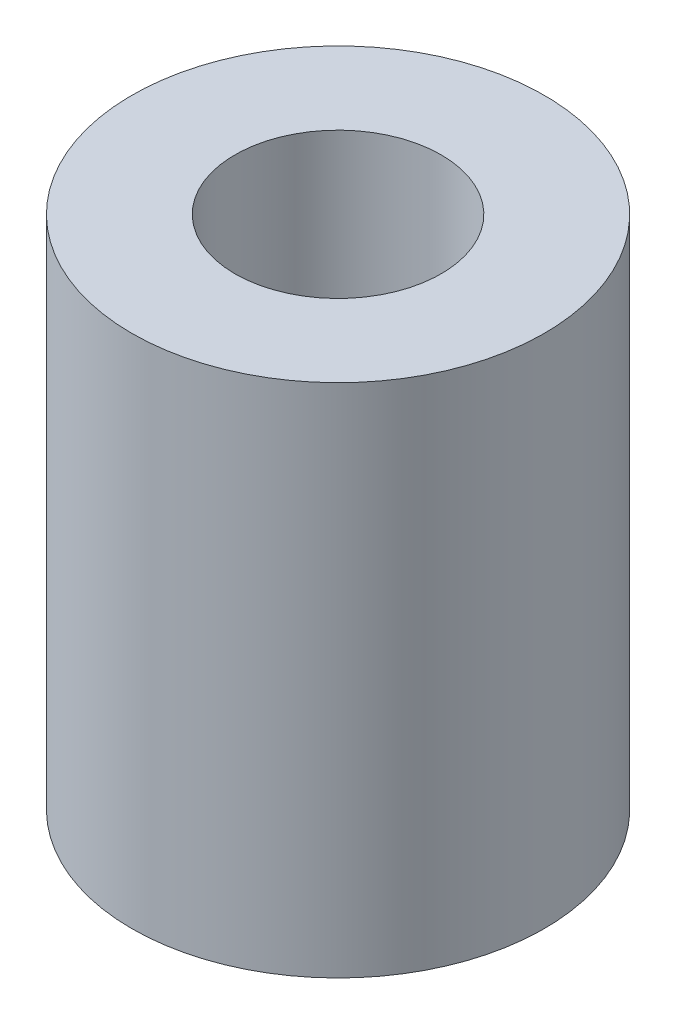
ISO-10303-21;
HEADER;
FILE_DESCRIPTION(('STEP AP214'),'2;1');
FILE_NAME('part.step','',(''),(''),'','','');
FILE_SCHEMA(('AUTOMOTIVE_DESIGN { 1 0 10303 214 1 1 1 1 }'));
ENDSEC;
DATA;
#1=APPLICATION_CONTEXT('core data for automotive mechanical design processes');
#2=APPLICATION_PROTOCOL_DEFINITION('international standard','automotive_design',2000,#1);
#3=PRODUCT_CONTEXT('',#1,'mechanical');
#4=PRODUCT('Part','Part','',(#3));
#5=PRODUCT_RELATED_PRODUCT_CATEGORY('part','',(#4));
#6=PRODUCT_DEFINITION_FORMATION('','',#4);
#7=PRODUCT_DEFINITION_CONTEXT('part definition',#1,'design');
#8=PRODUCT_DEFINITION('design','',#6,#7);
#9=PRODUCT_DEFINITION_SHAPE('','',#8);
#10=(LENGTH_UNIT() NAMED_UNIT(*) SI_UNIT(.MILLI.,.METRE.));
#11=(NAMED_UNIT(*) PLANE_ANGLE_UNIT() SI_UNIT($,.RADIAN.));
#12=(NAMED_UNIT(*) SI_UNIT($,.STERADIAN.) SOLID_ANGLE_UNIT());
#13=UNCERTAINTY_MEASURE_WITH_UNIT(LENGTH_MEASURE(1.E-05),#10,'distance_accuracy_value','');
#14=(GEOMETRIC_REPRESENTATION_CONTEXT(3) GLOBAL_UNCERTAINTY_ASSIGNED_CONTEXT((#13)) GLOBAL_UNIT_ASSIGNED_CONTEXT((#10,
#11,#12)) REPRESENTATION_CONTEXT('',''));
#15=CARTESIAN_POINT('',(0.,0.,0.));
#16=DIRECTION('',(0.,0.,1.));
#17=DIRECTION('',(1.,0.,0.));
#18=AXIS2_PLACEMENT_3D('',#15,#16,#17);
#19=CARTESIAN_POINT('',(0.,40.,0.));
#20=DIRECTION('',(0.,-1.,0.));
#21=DIRECTION('',(0.,0.,-1.));
#22=AXIS2_PLACEMENT_3D('',#19,#20,#21);
#23=CYLINDRICAL_SURFACE('',#22,16.);
#24=CARTESIAN_POINT('',(0.,40.,0.));
#25=DIRECTION('',(0.,1.,0.));
#26=DIRECTION('',(0.,0.,1.));
#27=AXIS2_PLACEMENT_3D('',#24,#25,#26);
#28=CIRCLE('',#27,16.);
#29=CARTESIAN_POINT('',(0.,40.,16.));
#30=VERTEX_POINT('',#29);
#31=EDGE_CURVE('E10',#30,#30,#28,.T.);
#32=ORIENTED_EDGE('',*,*,#31,.F.);
#33=EDGE_LOOP('',(#32));
#34=FACE_BOUND('',#33,.T.);
#35=CARTESIAN_POINT('',(0.,0.,0.));
#36=DIRECTION('',(0.,1.,0.));
#37=DIRECTION('',(0.,0.,1.));
#38=AXIS2_PLACEMENT_3D('',#35,#36,#37);
#39=CIRCLE('',#38,16.);
#40=CARTESIAN_POINT('',(0.,0.,16.));
#41=VERTEX_POINT('',#40);
#42=EDGE_CURVE('E45',#41,#41,#39,.T.);
#43=ORIENTED_EDGE('',*,*,#42,.T.);
#44=EDGE_LOOP('',(#43));
#45=FACE_BOUND('',#44,.T.);
#46=ADVANCED_FACE('F39',(#34,#45),#23,.T.);
#47=CARTESIAN_POINT('',(0.,40.,0.));
#48=DIRECTION('',(0.,1.,0.));
#49=DIRECTION('',(0.,0.,1.));
#50=AXIS2_PLACEMENT_3D('',#47,#48,#49);
#51=PLANE('',#50);
#52=CARTESIAN_POINT('',(0.,40.,0.));
#53=DIRECTION('',(0.,1.,0.));
#54=DIRECTION('',(0.,0.,1.));
#55=AXIS2_PLACEMENT_3D('',#52,#53,#54);
#56=CIRCLE('',#55,8.);
#57=CARTESIAN_POINT('',(0.,40.,8.));
#58=VERTEX_POINT('',#57);
#59=EDGE_CURVE('E51',#58,#58,#56,.T.);
#60=ORIENTED_EDGE('',*,*,#59,.F.);
#61=EDGE_LOOP('',(#60));
#62=FACE_BOUND('',#61,.T.);
#63=ORIENTED_EDGE('',*,*,#31,.T.);
#64=EDGE_LOOP('',(#63));
#65=FACE_BOUND('',#64,.T.);
#66=ADVANCED_FACE('F77',(#62,#65),#51,.T.);
#67=CARTESIAN_POINT('',(0.,0.,0.));
#68=DIRECTION('',(0.,1.,0.));
#69=DIRECTION('',(0.,0.,1.));
#70=AXIS2_PLACEMENT_3D('',#67,#68,#69);
#71=PLANE('',#70);
#72=CARTESIAN_POINT('',(0.,0.,0.));
#73=DIRECTION('',(0.,-1.,0.));
#74=DIRECTION('',(0.,0.,-1.));
#75=AXIS2_PLACEMENT_3D('',#72,#73,#74);
#76=CIRCLE('',#75,4.);
#77=CARTESIAN_POINT('',(0.,0.,-4.));
#78=VERTEX_POINT('',#77);
#79=EDGE_CURVE('E60',#78,#78,#76,.T.);
#80=ORIENTED_EDGE('',*,*,#79,.F.);
#81=EDGE_LOOP('',(#80));
#82=FACE_BOUND('',#81,.T.);
#83=ORIENTED_EDGE('',*,*,#42,.F.);
#84=EDGE_LOOP('',(#83));
#85=FACE_BOUND('',#84,.T.);
#86=ADVANCED_FACE('F72',(#82,#85),#71,.F.);
#87=CARTESIAN_POINT('',(0.,20.,0.));
#88=DIRECTION('',(0.,1.,0.));
#89=DIRECTION('',(0.,0.,1.));
#90=AXIS2_PLACEMENT_3D('',#87,#88,#89);
#91=CYLINDRICAL_SURFACE('',#90,8.);
#92=CARTESIAN_POINT('',(0.,20.,0.));
#93=DIRECTION('',(0.,1.,0.));
#94=DIRECTION('',(0.,0.,1.));
#95=AXIS2_PLACEMENT_3D('',#92,#93,#94);
#96=CIRCLE('',#95,8.);
#97=CARTESIAN_POINT('',(0.,20.,8.));
#98=VERTEX_POINT('',#97);
#99=EDGE_CURVE('E47',#98,#98,#96,.T.);
#100=ORIENTED_EDGE('',*,*,#99,.F.);
#101=EDGE_LOOP('',(#100));
#102=FACE_BOUND('',#101,.T.);
#103=ORIENTED_EDGE('',*,*,#59,.T.);
#104=EDGE_LOOP('',(#103));
#105=FACE_BOUND('',#104,.T.);
#106=ADVANCED_FACE('F75',(#102,#105),#91,.F.);
#107=CARTESIAN_POINT('',(0.,20.,0.));
#108=DIRECTION('',(0.,1.,0.));
#109=DIRECTION('',(0.,0.,1.));
#110=AXIS2_PLACEMENT_3D('',#107,#108,#109);
#111=PLANE('',#110);
#112=CARTESIAN_POINT('',(0.,20.,0.));
#113=DIRECTION('',(0.,-1.,0.));
#114=DIRECTION('',(0.,0.,-1.));
#115=AXIS2_PLACEMENT_3D('',#112,#113,#114);
#116=CIRCLE('',#115,4.);
#117=CARTESIAN_POINT('',(0.,20.,-4.));
#118=VERTEX_POINT('',#117);
#119=EDGE_CURVE('E53',#118,#118,#116,.T.);
#120=ORIENTED_EDGE('',*,*,#119,.T.);
#121=EDGE_LOOP('',(#120));
#122=FACE_BOUND('',#121,.T.);
#123=ORIENTED_EDGE('',*,*,#99,.T.);
#124=EDGE_LOOP('',(#123));
#125=FACE_BOUND('',#124,.T.);
#126=ADVANCED_FACE('F64',(#122,#125),#111,.T.);
#127=CARTESIAN_POINT('',(0.,20.,0.));
#128=DIRECTION('',(0.,-1.,0.));
#129=DIRECTION('',(0.,0.,-1.));
#130=AXIS2_PLACEMENT_3D('',#127,#128,#129);
#131=CYLINDRICAL_SURFACE('',#130,4.);
#132=ORIENTED_EDGE('',*,*,#119,.F.);
#133=EDGE_LOOP('',(#132));
#134=FACE_BOUND('',#133,.T.);
#135=ORIENTED_EDGE('',*,*,#79,.T.);
#136=EDGE_LOOP('',(#135));
#137=FACE_BOUND('',#136,.T.);
#138=ADVANCED_FACE('F67',(#134,#137),#131,.F.);
#139=CLOSED_SHELL('',(#46,#66,#86,#106,#126,#138));
#140=MANIFOLD_SOLID_BREP('B2',#139);
#141=ADVANCED_BREP_SHAPE_REPRESENTATION('',(#18,#140),#14);
#142=SHAPE_DEFINITION_REPRESENTATION(#9,#141);
ENDSEC;
END-ISO-10303-21;
